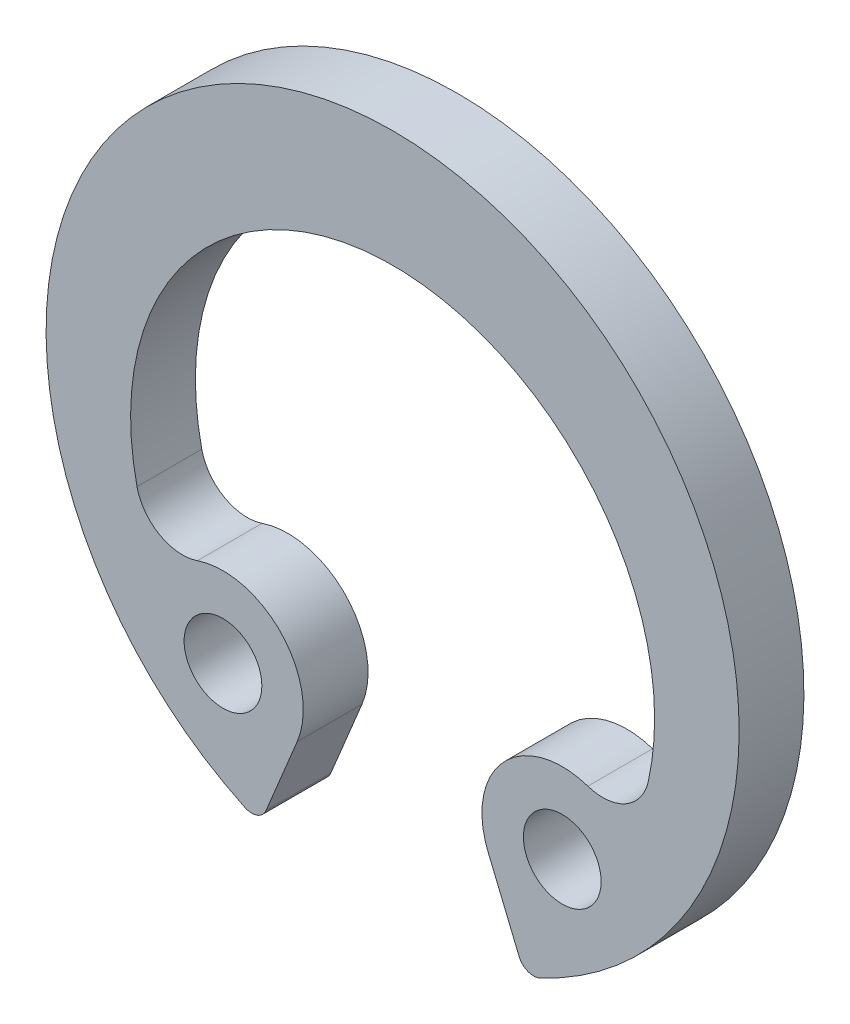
from build123d import *

# Parameters (mm, degrees)
BODYSKE_R      = 0.6
BASEBODY_DEPTH = 1
FILLET1_R      = 0.72
FILLET2_R      = 0.24


with BuildPart() as part:
    # BodySke → BaseBody (new body)
    with BuildSketch(Plane.XY):
        with BuildLine():
            Line((1.473435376, -3.557187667), (2.047356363, -4.942755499))
            ThreePointArc((2.047356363, -4.942755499), (0, 5.35), (-2.047356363, -4.942755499))
            Line((-2.047356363, -4.942755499), (-1.473435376, -3.557187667))
            ThreePointArc((-1.473435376, -3.557187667), (-1.742218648, -2.205922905), (-3.09348341, -1.937139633))
            Line((-3.09348341, -1.937139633), (-3.677728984, -2.179142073))
            ThreePointArc((-3.677728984, -2.179142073), (0, 3.55), (3.677728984, -2.179142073))
            Line((3.677728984, -2.179142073), (3.09348341, -1.937139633))
            ThreePointArc((3.09348341, -1.937139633), (1.742218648, -2.205922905), (1.473435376, -3.557187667))
        make_face()
        with Locations((2.618982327, -3.082686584)):
            Circle(BODYSKE_R, mode=Mode.SUBTRACT)
        with Locations((-2.618982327, -3.082686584)):
            Circle(BODYSKE_R, mode=Mode.SUBTRACT)
    extrude(amount=BASEBODY_DEPTH)

    # Fillet1
    fillet1_edges = [part.edges().sort_by_distance(p)[0] for p in [
        (3.677728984, -2.179142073, 0.5),
        (-3.677728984, -2.179142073, 0.5),
    ]]
    fillet(fillet1_edges, radius=FILLET1_R)

    # Fillet2
    fillet2_edges = [part.edges().sort_by_distance(p)[0] for p in [
        (-2.047356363, -4.942755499, 0.5),
        (2.047356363, -4.942755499, 0.5),
    ]]
    fillet(fillet2_edges, radius=FILLET2_R)


solid = part.part
